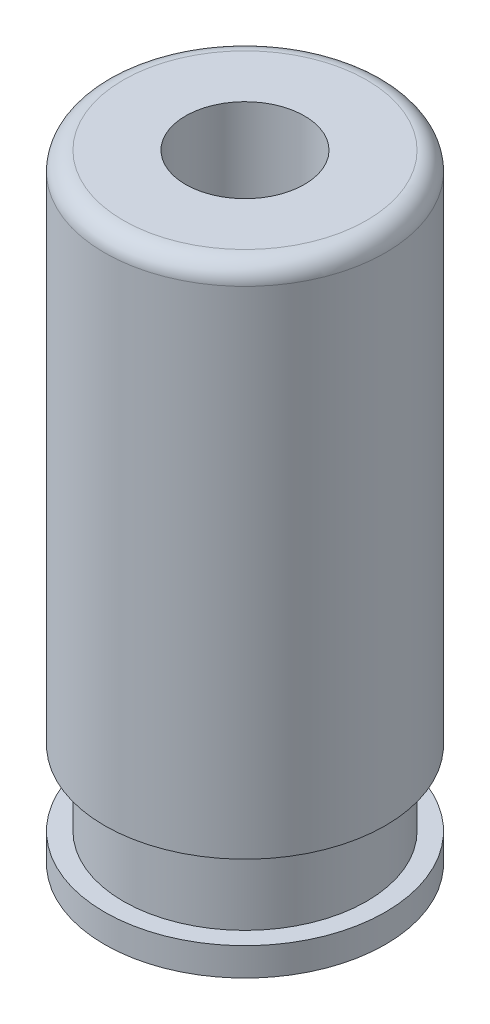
from build123d import *

# Parameters (mm, degrees)
SKETCH1_R           = 7.5
BOSS_EXTRUDE1_DEPTH = 33
SKETCH2_W           = 2
SKETCH2_H           = 4
SKETCH3_R           = 3.175
CUT_EXTRUDE1_DEPTH  = 5
FILLET1_R           = 1


with BuildPart() as part:
    # Sketch1 → Boss-Extrude1 (new body)
    with BuildSketch(Plane(origin=(0, 0, 0), x_dir=(1, 0, 0), z_dir=(0, 1, 0))):
        with Locations(Location((0, 0, 0), (0, 0, 270))):
            Circle(SKETCH1_R)
    extrude(amount=BOSS_EXTRUDE1_DEPTH)

    # Sketch2 → Cut-Revolve1 (revolve, cut)
    with BuildSketch(Plane.XY, mode=Mode.PRIVATE) as cut_revolve1_sk:
        with Locations((-7.5, 3.5)):
            Rectangle(SKETCH2_W, SKETCH2_H)
    revolve(cut_revolve1_sk.sketch.rotate(Axis((0, 33, 0), (0, -1, 0)), 270), axis=Axis((0, 33, 0), (0, -1, 0)), mode=Mode.SUBTRACT)

    # Sketch3 → Cut-Extrude1 (cut)
    with BuildSketch(Plane(origin=(0, 33, 0), x_dir=(1, 0, 0), z_dir=(0, 1, 0))):
        with Locations(Location((0, 0, 0), (0, 0, 270))):
            Circle(SKETCH3_R)
    extrude(amount=-CUT_EXTRUDE1_DEPTH, mode=Mode.SUBTRACT)

    # Fillet1
    fillet1_edges = [part.edges().sort_by_distance(p)[0] for p in [
        (0, 33, -7.5),
    ]]
    fillet(fillet1_edges, radius=FILLET1_R)


solid = part.part
